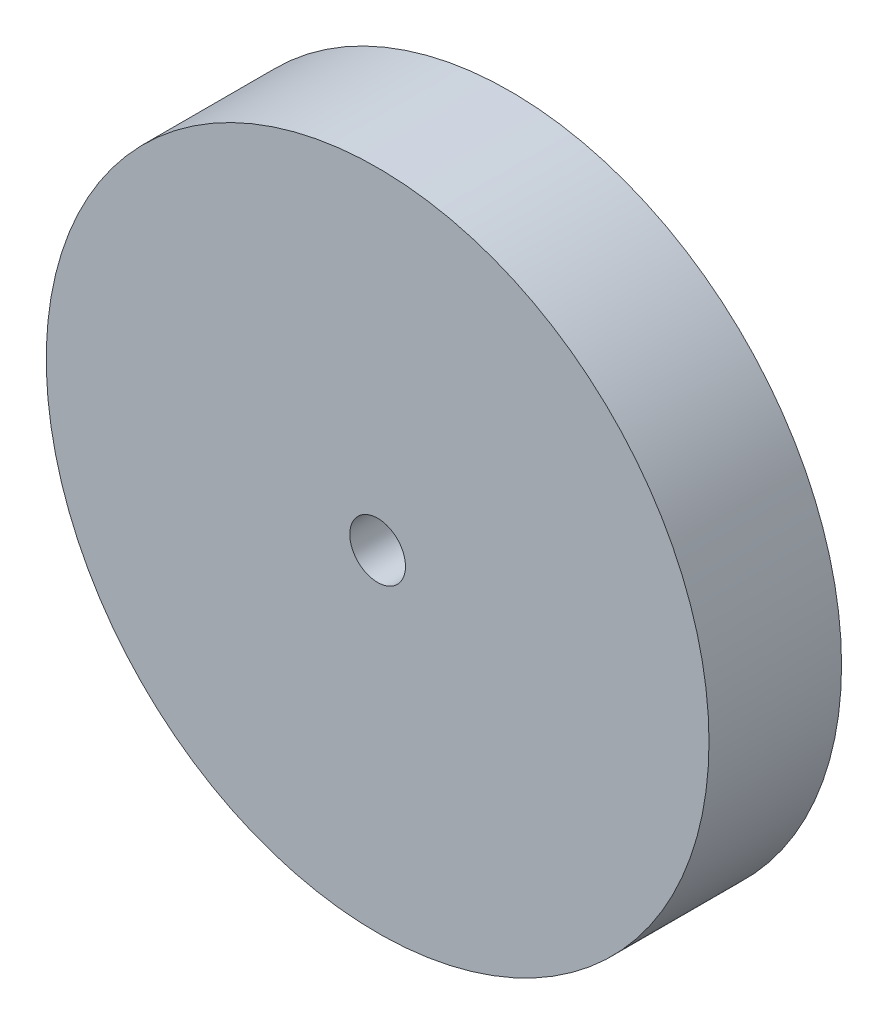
ISO-10303-21;
HEADER;
FILE_DESCRIPTION(('STEP AP214'),'2;1');
FILE_NAME('part.step','',(''),(''),'','','');
FILE_SCHEMA(('AUTOMOTIVE_DESIGN { 1 0 10303 214 1 1 1 1 }'));
ENDSEC;
DATA;
#1=APPLICATION_CONTEXT('core data for automotive mechanical design processes');
#2=APPLICATION_PROTOCOL_DEFINITION('international standard','automotive_design',2000,#1);
#3=PRODUCT_CONTEXT('',#1,'mechanical');
#4=PRODUCT('Part','Part','',(#3));
#5=PRODUCT_RELATED_PRODUCT_CATEGORY('part','',(#4));
#6=PRODUCT_DEFINITION_FORMATION('','',#4);
#7=PRODUCT_DEFINITION_CONTEXT('part definition',#1,'design');
#8=PRODUCT_DEFINITION('design','',#6,#7);
#9=PRODUCT_DEFINITION_SHAPE('','',#8);
#10=(LENGTH_UNIT() NAMED_UNIT(*) SI_UNIT(.MILLI.,.METRE.));
#11=(NAMED_UNIT(*) PLANE_ANGLE_UNIT() SI_UNIT($,.RADIAN.));
#12=(NAMED_UNIT(*) SI_UNIT($,.STERADIAN.) SOLID_ANGLE_UNIT());
#13=UNCERTAINTY_MEASURE_WITH_UNIT(LENGTH_MEASURE(1.E-05),#10,'distance_accuracy_value','');
#14=(GEOMETRIC_REPRESENTATION_CONTEXT(3) GLOBAL_UNCERTAINTY_ASSIGNED_CONTEXT((#13)) GLOBAL_UNIT_ASSIGNED_CONTEXT((#10,
#11,#12)) REPRESENTATION_CONTEXT('',''));
#15=CARTESIAN_POINT('',(0.,0.,0.));
#16=DIRECTION('',(0.,0.,1.));
#17=DIRECTION('',(1.,0.,0.));
#18=AXIS2_PLACEMENT_3D('',#15,#16,#17);
#19=CARTESIAN_POINT('',(0.,0.,10.));
#20=DIRECTION('',(0.,0.,-1.));
#21=DIRECTION('',(-1.,0.,0.));
#22=AXIS2_PLACEMENT_3D('',#19,#20,#21);
#23=CYLINDRICAL_SURFACE('',#22,25.);
#24=CARTESIAN_POINT('',(0.,0.,10.));
#25=DIRECTION('',(0.,0.,1.));
#26=DIRECTION('',(1.,0.,0.));
#27=AXIS2_PLACEMENT_3D('',#24,#25,#26);
#28=CIRCLE('',#27,25.);
#29=CARTESIAN_POINT('',(25.,0.,10.));
#30=VERTEX_POINT('',#29);
#31=EDGE_CURVE('E10',#30,#30,#28,.T.);
#32=ORIENTED_EDGE('',*,*,#31,.F.);
#33=EDGE_LOOP('',(#32));
#34=FACE_BOUND('',#33,.T.);
#35=CARTESIAN_POINT('',(0.,0.,0.));
#36=DIRECTION('',(0.,0.,1.));
#37=DIRECTION('',(1.,0.,0.));
#38=AXIS2_PLACEMENT_3D('',#35,#36,#37);
#39=CIRCLE('',#38,25.);
#40=CARTESIAN_POINT('',(25.,0.,0.));
#41=VERTEX_POINT('',#40);
#42=EDGE_CURVE('E34',#41,#41,#39,.T.);
#43=ORIENTED_EDGE('',*,*,#42,.T.);
#44=EDGE_LOOP('',(#43));
#45=FACE_BOUND('',#44,.T.);
#46=ADVANCED_FACE('F31',(#34,#45),#23,.T.);
#47=CARTESIAN_POINT('',(0.,0.,10.));
#48=DIRECTION('',(0.,0.,1.));
#49=DIRECTION('',(1.,0.,0.));
#50=AXIS2_PLACEMENT_3D('',#47,#48,#49);
#51=PLANE('',#50);
#52=CARTESIAN_POINT('',(0.,0.,10.));
#53=DIRECTION('',(0.,0.,1.));
#54=DIRECTION('',(1.,0.,0.));
#55=AXIS2_PLACEMENT_3D('',#52,#53,#54);
#56=CIRCLE('',#55,2.09999999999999);
#57=CARTESIAN_POINT('',(2.09999999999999,0.,10.));
#58=VERTEX_POINT('',#57);
#59=EDGE_CURVE('E45',#58,#58,#56,.T.);
#60=ORIENTED_EDGE('',*,*,#59,.F.);
#61=EDGE_LOOP('',(#60));
#62=FACE_BOUND('',#61,.T.);
#63=ORIENTED_EDGE('',*,*,#31,.T.);
#64=EDGE_LOOP('',(#63));
#65=FACE_BOUND('',#64,.T.);
#66=ADVANCED_FACE('F51',(#62,#65),#51,.T.);
#67=CARTESIAN_POINT('',(0.,0.,0.));
#68=DIRECTION('',(0.,0.,1.));
#69=DIRECTION('',(1.,0.,0.));
#70=AXIS2_PLACEMENT_3D('',#67,#68,#69);
#71=PLANE('',#70);
#72=CARTESIAN_POINT('',(0.,0.,0.));
#73=DIRECTION('',(0.,0.,1.));
#74=DIRECTION('',(1.,0.,0.));
#75=AXIS2_PLACEMENT_3D('',#72,#73,#74);
#76=CIRCLE('',#75,2.1);
#77=CARTESIAN_POINT('',(2.1,0.,0.));
#78=VERTEX_POINT('',#77);
#79=EDGE_CURVE('E41',#78,#78,#76,.T.);
#80=ORIENTED_EDGE('',*,*,#79,.T.);
#81=EDGE_LOOP('',(#80));
#82=FACE_BOUND('',#81,.T.);
#83=ORIENTED_EDGE('',*,*,#42,.F.);
#84=EDGE_LOOP('',(#83));
#85=FACE_BOUND('',#84,.T.);
#86=ADVANCED_FACE('F53',(#82,#85),#71,.F.);
#87=CARTESIAN_POINT('',(0.,0.,10.));
#88=DIRECTION('',(0.,0.,1.));
#89=DIRECTION('',(1.,0.,0.));
#90=AXIS2_PLACEMENT_3D('',#87,#88,#89);
#91=CYLINDRICAL_SURFACE('',#90,2.09999999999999);
#92=ORIENTED_EDGE('',*,*,#79,.F.);
#93=EDGE_LOOP('',(#92));
#94=FACE_BOUND('',#93,.T.);
#95=ORIENTED_EDGE('',*,*,#59,.T.);
#96=EDGE_LOOP('',(#95));
#97=FACE_BOUND('',#96,.T.);
#98=ADVANCED_FACE('F49',(#94,#97),#91,.F.);
#99=CLOSED_SHELL('',(#46,#66,#86,#98));
#100=MANIFOLD_SOLID_BREP('B2',#99);
#101=ADVANCED_BREP_SHAPE_REPRESENTATION('',(#18,#100),#14);
#102=SHAPE_DEFINITION_REPRESENTATION(#9,#101);
ENDSEC;
END-ISO-10303-21;
